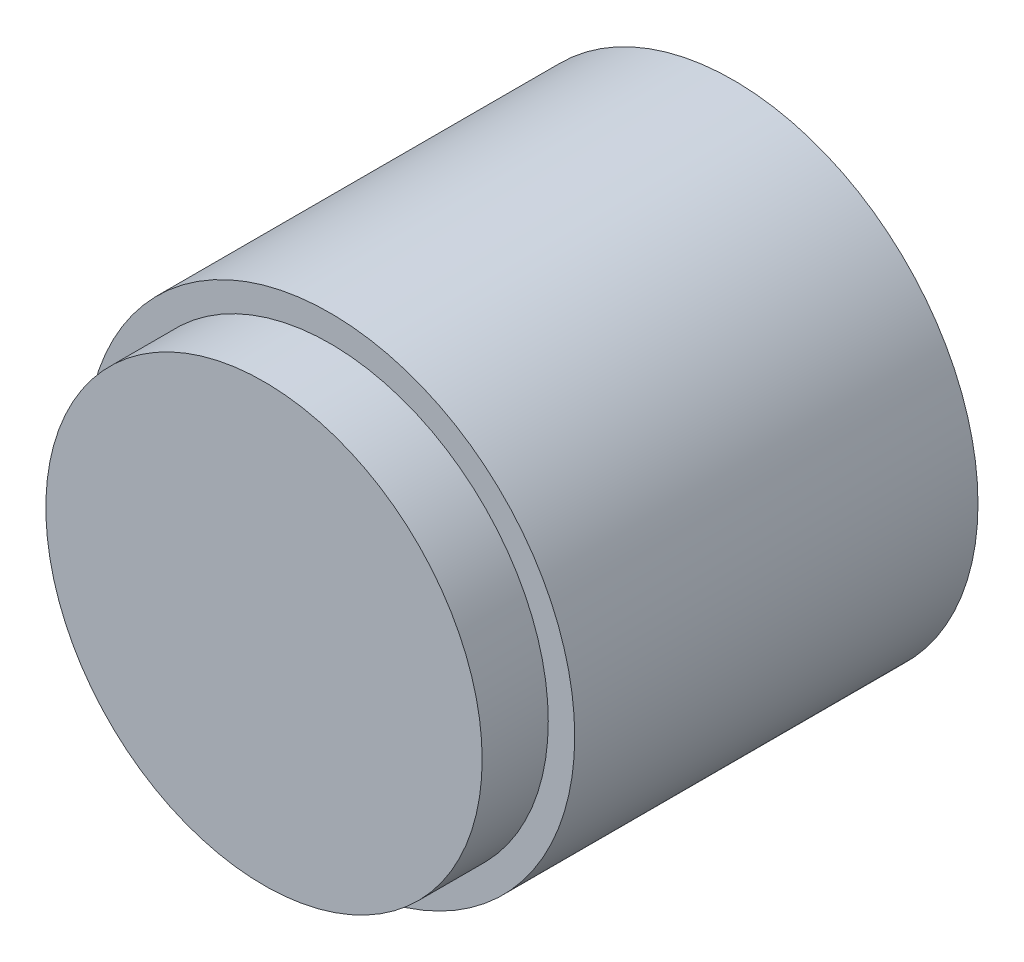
ISO-10303-21;
HEADER;
FILE_DESCRIPTION(('STEP AP214'),'2;1');
FILE_NAME('part.step','',(''),(''),'','','');
FILE_SCHEMA(('AUTOMOTIVE_DESIGN { 1 0 10303 214 1 1 1 1 }'));
ENDSEC;
DATA;
#1=APPLICATION_CONTEXT('core data for automotive mechanical design processes');
#2=APPLICATION_PROTOCOL_DEFINITION('international standard','automotive_design',2000,#1);
#3=PRODUCT_CONTEXT('',#1,'mechanical');
#4=PRODUCT('Part','Part','',(#3));
#5=PRODUCT_RELATED_PRODUCT_CATEGORY('part','',(#4));
#6=PRODUCT_DEFINITION_FORMATION('','',#4);
#7=PRODUCT_DEFINITION_CONTEXT('part definition',#1,'design');
#8=PRODUCT_DEFINITION('design','',#6,#7);
#9=PRODUCT_DEFINITION_SHAPE('','',#8);
#10=(LENGTH_UNIT() NAMED_UNIT(*) SI_UNIT(.MILLI.,.METRE.));
#11=(NAMED_UNIT(*) PLANE_ANGLE_UNIT() SI_UNIT($,.RADIAN.));
#12=(NAMED_UNIT(*) SI_UNIT($,.STERADIAN.) SOLID_ANGLE_UNIT());
#13=UNCERTAINTY_MEASURE_WITH_UNIT(LENGTH_MEASURE(1.E-05),#10,'distance_accuracy_value','');
#14=(GEOMETRIC_REPRESENTATION_CONTEXT(3) GLOBAL_UNCERTAINTY_ASSIGNED_CONTEXT((#13)) GLOBAL_UNIT_ASSIGNED_CONTEXT((#10,
#11,#12)) REPRESENTATION_CONTEXT('',''));
#15=CARTESIAN_POINT('',(0.,0.,0.));
#16=DIRECTION('',(0.,0.,1.));
#17=DIRECTION('',(1.,0.,0.));
#18=AXIS2_PLACEMENT_3D('',#15,#16,#17);
#19=CARTESIAN_POINT('',(0.,0.,300.));
#20=DIRECTION('',(0.,0.,-1.));
#21=DIRECTION('',(-1.,0.,0.));
#22=AXIS2_PLACEMENT_3D('',#19,#20,#21);
#23=CYLINDRICAL_SURFACE('',#22,45.);
#24=CARTESIAN_POINT('',(0.,0.,0.));
#25=DIRECTION('',(0.,0.,-1.));
#26=DIRECTION('',(-1.,0.,0.));
#27=AXIS2_PLACEMENT_3D('',#24,#25,#26);
#28=CIRCLE('',#27,45.);
#29=CARTESIAN_POINT('',(-45.,0.,0.));
#30=VERTEX_POINT('',#29);
#31=EDGE_CURVE('E54',#30,#30,#28,.T.);
#32=ORIENTED_EDGE('',*,*,#31,.T.);
#33=EDGE_LOOP('',(#32));
#34=FACE_BOUND('',#33,.T.);
#35=CARTESIAN_POINT('',(0.,0.,5.));
#36=DIRECTION('',(0.,0.,1.));
#37=DIRECTION('',(1.,0.,0.));
#38=AXIS2_PLACEMENT_3D('',#35,#36,#37);
#39=CIRCLE('',#38,45.);
#40=CARTESIAN_POINT('',(45.,0.,5.));
#41=VERTEX_POINT('',#40);
#42=EDGE_CURVE('E62',#41,#41,#39,.F.);
#43=ORIENTED_EDGE('',*,*,#42,.F.);
#44=EDGE_LOOP('',(#43));
#45=FACE_BOUND('',#44,.T.);
#46=ADVANCED_FACE('F42',(#34,#45),#23,.F.);
#47=CARTESIAN_POINT('',(0.,0.,300.));
#48=DIRECTION('',(0.,0.,-1.));
#49=DIRECTION('',(-1.,0.,0.));
#50=AXIS2_PLACEMENT_3D('',#47,#48,#49);
#51=CYLINDRICAL_SURFACE('',#50,185.);
#52=CARTESIAN_POINT('',(0.,0.,0.));
#53=DIRECTION('',(0.,0.,1.));
#54=DIRECTION('',(1.,0.,0.));
#55=AXIS2_PLACEMENT_3D('',#52,#53,#54);
#56=CIRCLE('',#55,185.);
#57=CARTESIAN_POINT('',(185.,0.,0.));
#58=VERTEX_POINT('',#57);
#59=EDGE_CURVE('E46',#58,#58,#56,.T.);
#60=ORIENTED_EDGE('',*,*,#59,.T.);
#61=EDGE_LOOP('',(#60));
#62=FACE_BOUND('',#61,.T.);
#63=CARTESIAN_POINT('',(0.,0.,305.));
#64=DIRECTION('',(0.,0.,1.));
#65=DIRECTION('',(1.,0.,0.));
#66=AXIS2_PLACEMENT_3D('',#63,#64,#65);
#67=CIRCLE('',#66,185.);
#68=CARTESIAN_POINT('',(185.,0.,305.));
#69=VERTEX_POINT('',#68);
#70=EDGE_CURVE('E58',#69,#69,#67,.T.);
#71=ORIENTED_EDGE('',*,*,#70,.F.);
#72=EDGE_LOOP('',(#71));
#73=FACE_BOUND('',#72,.T.);
#74=ADVANCED_FACE('F44',(#62,#73),#51,.T.);
#75=CARTESIAN_POINT('',(0.,0.,0.));
#76=DIRECTION('',(0.,0.,1.));
#77=DIRECTION('',(1.,0.,0.));
#78=AXIS2_PLACEMENT_3D('',#75,#76,#77);
#79=PLANE('',#78);
#80=ORIENTED_EDGE('',*,*,#31,.F.);
#81=EDGE_LOOP('',(#80));
#82=FACE_BOUND('',#81,.T.);
#83=ORIENTED_EDGE('',*,*,#59,.F.);
#84=EDGE_LOOP('',(#83));
#85=FACE_BOUND('',#84,.T.);
#86=ADVANCED_FACE('F74',(#82,#85),#79,.F.);
#87=CARTESIAN_POINT('',(0.,0.,5.));
#88=DIRECTION('',(0.,0.,1.));
#89=DIRECTION('',(1.,0.,0.));
#90=AXIS2_PLACEMENT_3D('',#87,#88,#89);
#91=CYLINDRICAL_SURFACE('',#90,175.);
#92=CARTESIAN_POINT('',(0.,0.,5.));
#93=DIRECTION('',(0.,0.,1.));
#94=DIRECTION('',(1.,0.,0.));
#95=AXIS2_PLACEMENT_3D('',#92,#93,#94);
#96=CIRCLE('',#95,175.);
#97=CARTESIAN_POINT('',(175.,0.,5.));
#98=VERTEX_POINT('',#97);
#99=EDGE_CURVE('E65',#98,#98,#96,.T.);
#100=ORIENTED_EDGE('',*,*,#99,.F.);
#101=EDGE_LOOP('',(#100));
#102=FACE_BOUND('',#101,.T.);
#103=CARTESIAN_POINT('',(0.,0.,300.));
#104=DIRECTION('',(0.,0.,1.));
#105=DIRECTION('',(1.,0.,0.));
#106=AXIS2_PLACEMENT_3D('',#103,#104,#105);
#107=CIRCLE('',#106,175.);
#108=CARTESIAN_POINT('',(175.,0.,300.));
#109=VERTEX_POINT('',#108);
#110=EDGE_CURVE('E61',#109,#109,#107,.T.);
#111=ORIENTED_EDGE('',*,*,#110,.T.);
#112=EDGE_LOOP('',(#111));
#113=FACE_BOUND('',#112,.T.);
#114=ADVANCED_FACE('F77',(#102,#113),#91,.F.);
#115=CARTESIAN_POINT('',(0.,0.,5.));
#116=DIRECTION('',(0.,0.,1.));
#117=DIRECTION('',(1.,0.,0.));
#118=AXIS2_PLACEMENT_3D('',#115,#116,#117);
#119=PLANE('',#118);
#120=ORIENTED_EDGE('',*,*,#42,.T.);
#121=EDGE_LOOP('',(#120));
#122=FACE_BOUND('',#121,.T.);
#123=ORIENTED_EDGE('',*,*,#99,.T.);
#124=EDGE_LOOP('',(#123));
#125=FACE_BOUND('',#124,.T.);
#126=ADVANCED_FACE('F97',(#122,#125),#119,.T.);
#127=CARTESIAN_POINT('',(0.,0.,300.));
#128=DIRECTION('',(0.,0.,1.));
#129=DIRECTION('',(1.,0.,0.));
#130=AXIS2_PLACEMENT_3D('',#127,#128,#129);
#131=PLANE('',#130);
#132=ORIENTED_EDGE('',*,*,#110,.F.);
#133=EDGE_LOOP('',(#132));
#134=FACE_BOUND('',#133,.T.);
#135=ADVANCED_FACE('F87',(#134),#131,.F.);
#136=CARTESIAN_POINT('',(0.,0.,305.));
#137=DIRECTION('',(0.,0.,1.));
#138=DIRECTION('',(1.,0.,0.));
#139=AXIS2_PLACEMENT_3D('',#136,#137,#138);
#140=PLANE('',#139);
#141=CARTESIAN_POINT('',(0.,0.,305.));
#142=DIRECTION('',(0.,0.,1.));
#143=DIRECTION('',(1.,0.,0.));
#144=AXIS2_PLACEMENT_3D('',#141,#142,#143);
#145=CIRCLE('',#144,165.);
#146=CARTESIAN_POINT('',(165.,0.,305.));
#147=VERTEX_POINT('',#146);
#148=EDGE_CURVE('E10',#147,#147,#145,.T.);
#149=ORIENTED_EDGE('',*,*,#148,.F.);
#150=EDGE_LOOP('',(#149));
#151=FACE_BOUND('',#150,.T.);
#152=ORIENTED_EDGE('',*,*,#70,.T.);
#153=EDGE_LOOP('',(#152));
#154=FACE_BOUND('',#153,.T.);
#155=ADVANCED_FACE('F84',(#151,#154),#140,.T.);
#156=CARTESIAN_POINT('',(0.,0.,355.));
#157=DIRECTION('',(0.,0.,-1.));
#158=DIRECTION('',(-1.,0.,0.));
#159=AXIS2_PLACEMENT_3D('',#156,#157,#158);
#160=CYLINDRICAL_SURFACE('',#159,165.);
#161=CARTESIAN_POINT('',(0.,0.,355.));
#162=DIRECTION('',(0.,0.,1.));
#163=DIRECTION('',(1.,0.,0.));
#164=AXIS2_PLACEMENT_3D('',#161,#162,#163);
#165=CIRCLE('',#164,165.);
#166=CARTESIAN_POINT('',(165.,0.,355.));
#167=VERTEX_POINT('',#166);
#168=EDGE_CURVE('E57',#167,#167,#165,.T.);
#169=ORIENTED_EDGE('',*,*,#168,.F.);
#170=EDGE_LOOP('',(#169));
#171=FACE_BOUND('',#170,.T.);
#172=ORIENTED_EDGE('',*,*,#148,.T.);
#173=EDGE_LOOP('',(#172));
#174=FACE_BOUND('',#173,.T.);
#175=ADVANCED_FACE('F86',(#171,#174),#160,.T.);
#176=CARTESIAN_POINT('',(0.,0.,355.));
#177=DIRECTION('',(0.,0.,1.));
#178=DIRECTION('',(1.,0.,0.));
#179=AXIS2_PLACEMENT_3D('',#176,#177,#178);
#180=PLANE('',#179);
#181=ORIENTED_EDGE('',*,*,#168,.T.);
#182=EDGE_LOOP('',(#181));
#183=FACE_BOUND('',#182,.T.);
#184=ADVANCED_FACE('F94',(#183),#180,.T.);
#185=CLOSED_SHELL('',(#46,#74,#86,#114,#126,#135,#155,#175,#184));
#186=MANIFOLD_SOLID_BREP('B2',#185);
#187=ADVANCED_BREP_SHAPE_REPRESENTATION('',(#18,#186),#14);
#188=SHAPE_DEFINITION_REPRESENTATION(#9,#187);
ENDSEC;
END-ISO-10303-21;
